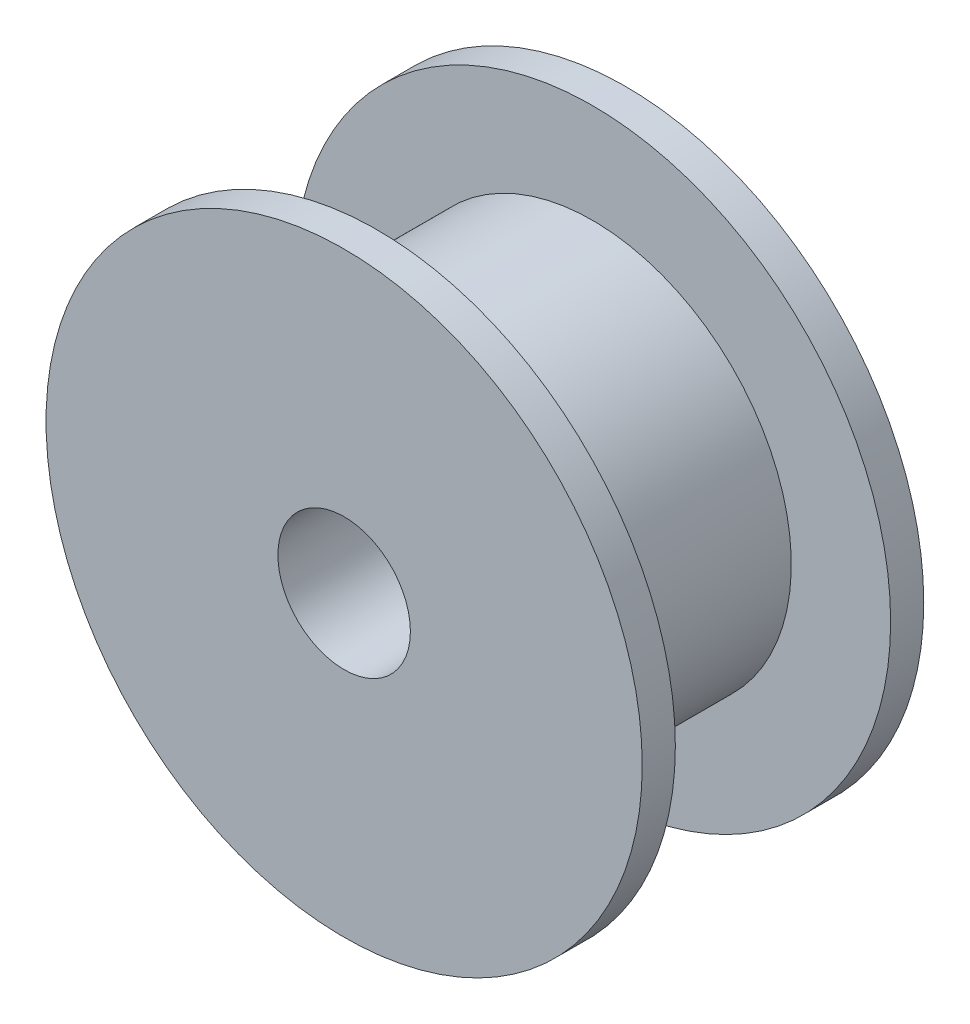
ISO-10303-21;
HEADER;
FILE_DESCRIPTION(('STEP AP214'),'2;1');
FILE_NAME('part.step','',(''),(''),'','','');
FILE_SCHEMA(('AUTOMOTIVE_DESIGN { 1 0 10303 214 1 1 1 1 }'));
ENDSEC;
DATA;
#1=APPLICATION_CONTEXT('core data for automotive mechanical design processes');
#2=APPLICATION_PROTOCOL_DEFINITION('international standard','automotive_design',2000,#1);
#3=PRODUCT_CONTEXT('',#1,'mechanical');
#4=PRODUCT('Part','Part','',(#3));
#5=PRODUCT_RELATED_PRODUCT_CATEGORY('part','',(#4));
#6=PRODUCT_DEFINITION_FORMATION('','',#4);
#7=PRODUCT_DEFINITION_CONTEXT('part definition',#1,'design');
#8=PRODUCT_DEFINITION('design','',#6,#7);
#9=PRODUCT_DEFINITION_SHAPE('','',#8);
#10=(LENGTH_UNIT() NAMED_UNIT(*) SI_UNIT(.MILLI.,.METRE.));
#11=(NAMED_UNIT(*) PLANE_ANGLE_UNIT() SI_UNIT($,.RADIAN.));
#12=(NAMED_UNIT(*) SI_UNIT($,.STERADIAN.) SOLID_ANGLE_UNIT());
#13=UNCERTAINTY_MEASURE_WITH_UNIT(LENGTH_MEASURE(1.E-05),#10,'distance_accuracy_value','');
#14=(GEOMETRIC_REPRESENTATION_CONTEXT(3) GLOBAL_UNCERTAINTY_ASSIGNED_CONTEXT((#13)) GLOBAL_UNIT_ASSIGNED_CONTEXT((#10,
#11,#12)) REPRESENTATION_CONTEXT('',''));
#15=CARTESIAN_POINT('',(0.,0.,0.));
#16=DIRECTION('',(0.,0.,1.));
#17=DIRECTION('',(1.,0.,0.));
#18=AXIS2_PLACEMENT_3D('',#15,#16,#17);
#19=CARTESIAN_POINT('',(0.,0.,1.));
#20=DIRECTION('',(0.,0.,1.));
#21=DIRECTION('',(1.,0.,0.));
#22=AXIS2_PLACEMENT_3D('',#19,#20,#21);
#23=PLANE('',#22);
#24=CARTESIAN_POINT('',(0.,0.,1.));
#25=DIRECTION('',(0.,0.,1.));
#26=DIRECTION('',(1.,0.,0.));
#27=AXIS2_PLACEMENT_3D('',#24,#25,#26);
#28=CIRCLE('',#27,9.);
#29=CARTESIAN_POINT('',(9.,0.,1.));
#30=VERTEX_POINT('',#29);
#31=EDGE_CURVE('E10',#30,#30,#28,.T.);
#32=ORIENTED_EDGE('',*,*,#31,.T.);
#33=EDGE_LOOP('',(#32));
#34=FACE_BOUND('',#33,.T.);
#35=CARTESIAN_POINT('',(0.,0.,1.));
#36=DIRECTION('',(0.,0.,1.));
#37=DIRECTION('',(1.,0.,0.));
#38=AXIS2_PLACEMENT_3D('',#35,#36,#37);
#39=CIRCLE('',#38,6.);
#40=CARTESIAN_POINT('',(-6.,0.,1.));
#41=VERTEX_POINT('',#40);
#42=EDGE_CURVE('E56',#41,#41,#39,.T.);
#43=ORIENTED_EDGE('',*,*,#42,.F.);
#44=EDGE_LOOP('',(#43));
#45=FACE_BOUND('',#44,.T.);
#46=ADVANCED_FACE('F37',(#34,#45),#23,.T.);
#47=CARTESIAN_POINT('',(0.,0.,0.));
#48=DIRECTION('',(0.,0.,1.));
#49=DIRECTION('',(1.,0.,0.));
#50=AXIS2_PLACEMENT_3D('',#47,#48,#49);
#51=PLANE('',#50);
#52=CARTESIAN_POINT('',(0.,0.,0.));
#53=DIRECTION('',(0.,0.,1.));
#54=DIRECTION('',(1.,0.,0.));
#55=AXIS2_PLACEMENT_3D('',#52,#53,#54);
#56=CIRCLE('',#55,9.);
#57=CARTESIAN_POINT('',(9.,0.,0.));
#58=VERTEX_POINT('',#57);
#59=EDGE_CURVE('E41',#58,#58,#56,.T.);
#60=ORIENTED_EDGE('',*,*,#59,.F.);
#61=EDGE_LOOP('',(#60));
#62=FACE_BOUND('',#61,.T.);
#63=CARTESIAN_POINT('',(0.,0.,0.));
#64=DIRECTION('',(0.,0.,1.));
#65=DIRECTION('',(1.,0.,0.));
#66=AXIS2_PLACEMENT_3D('',#63,#64,#65);
#67=CIRCLE('',#66,2.);
#68=CARTESIAN_POINT('',(2.,0.,0.));
#69=VERTEX_POINT('',#68);
#70=EDGE_CURVE('E50',#69,#69,#67,.T.);
#71=ORIENTED_EDGE('',*,*,#70,.T.);
#72=EDGE_LOOP('',(#71));
#73=FACE_BOUND('',#72,.T.);
#74=ADVANCED_FACE('F94',(#62,#73),#51,.F.);
#75=CARTESIAN_POINT('',(0.,0.,1.));
#76=DIRECTION('',(0.,0.,-1.));
#77=DIRECTION('',(-1.,0.,0.));
#78=AXIS2_PLACEMENT_3D('',#75,#76,#77);
#79=CYLINDRICAL_SURFACE('',#78,9.);
#80=ORIENTED_EDGE('',*,*,#31,.F.);
#81=EDGE_LOOP('',(#80));
#82=FACE_BOUND('',#81,.T.);
#83=ORIENTED_EDGE('',*,*,#59,.T.);
#84=EDGE_LOOP('',(#83));
#85=FACE_BOUND('',#84,.T.);
#86=ADVANCED_FACE('F39',(#82,#85),#79,.T.);
#87=CARTESIAN_POINT('',(0.,0.,1.));
#88=DIRECTION('',(0.,0.,-1.));
#89=DIRECTION('',(-1.,0.,0.));
#90=AXIS2_PLACEMENT_3D('',#87,#88,#89);
#91=CYLINDRICAL_SURFACE('',#90,2.);
#92=ORIENTED_EDGE('',*,*,#70,.F.);
#93=EDGE_LOOP('',(#92));
#94=FACE_BOUND('',#93,.T.);
#95=CARTESIAN_POINT('',(0.,0.,8.5));
#96=DIRECTION('',(0.,0.,1.));
#97=DIRECTION('',(1.,0.,0.));
#98=AXIS2_PLACEMENT_3D('',#95,#96,#97);
#99=CIRCLE('',#98,2.);
#100=CARTESIAN_POINT('',(2.,0.,8.5));
#101=VERTEX_POINT('',#100);
#102=EDGE_CURVE('E68',#101,#101,#99,.T.);
#103=ORIENTED_EDGE('',*,*,#102,.T.);
#104=EDGE_LOOP('',(#103));
#105=FACE_BOUND('',#104,.T.);
#106=ADVANCED_FACE('F76',(#94,#105),#91,.F.);
#107=CARTESIAN_POINT('',(0.,0.,7.5));
#108=DIRECTION('',(0.,0.,-1.));
#109=DIRECTION('',(-1.,0.,0.));
#110=AXIS2_PLACEMENT_3D('',#107,#108,#109);
#111=CYLINDRICAL_SURFACE('',#110,6.);
#112=CARTESIAN_POINT('',(0.,0.,7.5));
#113=DIRECTION('',(0.,0.,1.));
#114=DIRECTION('',(1.,0.,0.));
#115=AXIS2_PLACEMENT_3D('',#112,#113,#114);
#116=CIRCLE('',#115,6.);
#117=CARTESIAN_POINT('',(-6.,0.,7.5));
#118=VERTEX_POINT('',#117);
#119=EDGE_CURVE('E55',#118,#118,#116,.T.);
#120=CARTESIAN_POINT('',(-6.,0.,7.5));
#121=CARTESIAN_POINT('',(-6.,0.,7.43229166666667));
#122=CARTESIAN_POINT('',(-6.,0.,7.36458333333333));
#123=CARTESIAN_POINT('',(-6.,0.,7.22916666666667));
#124=CARTESIAN_POINT('',(-6.,0.,7.16145833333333));
#125=CARTESIAN_POINT('',(-6.,0.,7.02604166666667));
#126=CARTESIAN_POINT('',(-6.,0.,6.95833333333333));
#127=CARTESIAN_POINT('',(-6.,0.,6.82291666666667));
#128=CARTESIAN_POINT('',(-6.,0.,6.75520833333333));
#129=CARTESIAN_POINT('',(-6.,0.,6.61979166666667));
#130=CARTESIAN_POINT('',(-6.,0.,6.55208333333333));
#131=CARTESIAN_POINT('',(-6.,0.,6.41666666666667));
#132=CARTESIAN_POINT('',(-6.,0.,6.34895833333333));
#133=CARTESIAN_POINT('',(-6.,0.,6.21354166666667));
#134=CARTESIAN_POINT('',(-6.,0.,6.14583333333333));
#135=CARTESIAN_POINT('',(-6.,0.,6.01041666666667));
#136=CARTESIAN_POINT('',(-6.,0.,5.94270833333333));
#137=CARTESIAN_POINT('',(-6.,0.,5.80729166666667));
#138=CARTESIAN_POINT('',(-6.,0.,5.73958333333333));
#139=CARTESIAN_POINT('',(-6.,0.,5.60416666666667));
#140=CARTESIAN_POINT('',(-6.,0.,5.53645833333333));
#141=CARTESIAN_POINT('',(-6.,0.,5.40104166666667));
#142=CARTESIAN_POINT('',(-6.,0.,5.33333333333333));
#143=CARTESIAN_POINT('',(-6.,0.,5.19791666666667));
#144=CARTESIAN_POINT('',(-6.,0.,5.13020833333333));
#145=CARTESIAN_POINT('',(-6.,0.,4.99479166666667));
#146=CARTESIAN_POINT('',(-6.,0.,4.92708333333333));
#147=CARTESIAN_POINT('',(-6.,0.,4.79166666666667));
#148=CARTESIAN_POINT('',(-6.,0.,4.72395833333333));
#149=CARTESIAN_POINT('',(-6.,0.,4.58854166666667));
#150=CARTESIAN_POINT('',(-6.,0.,4.52083333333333));
#151=CARTESIAN_POINT('',(-6.,0.,4.38541666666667));
#152=CARTESIAN_POINT('',(-6.,0.,4.31770833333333));
#153=CARTESIAN_POINT('',(-6.,0.,4.18229166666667));
#154=CARTESIAN_POINT('',(-6.,0.,4.11458333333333));
#155=CARTESIAN_POINT('',(-6.,0.,3.97916666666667));
#156=CARTESIAN_POINT('',(-6.,0.,3.91145833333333));
#157=CARTESIAN_POINT('',(-6.,0.,3.77604166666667));
#158=CARTESIAN_POINT('',(-6.,0.,3.70833333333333));
#159=CARTESIAN_POINT('',(-6.,0.,3.57291666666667));
#160=CARTESIAN_POINT('',(-6.,0.,3.50520833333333));
#161=CARTESIAN_POINT('',(-6.,0.,3.36979166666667));
#162=CARTESIAN_POINT('',(-6.,0.,3.30208333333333));
#163=CARTESIAN_POINT('',(-6.,0.,3.16666666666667));
#164=CARTESIAN_POINT('',(-6.,0.,3.09895833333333));
#165=CARTESIAN_POINT('',(-6.,0.,2.96354166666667));
#166=CARTESIAN_POINT('',(-6.,0.,2.89583333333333));
#167=CARTESIAN_POINT('',(-6.,0.,2.76041666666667));
#168=CARTESIAN_POINT('',(-6.,0.,2.69270833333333));
#169=CARTESIAN_POINT('',(-6.,0.,2.55729166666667));
#170=CARTESIAN_POINT('',(-6.,0.,2.48958333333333));
#171=CARTESIAN_POINT('',(-6.,0.,2.35416666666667));
#172=CARTESIAN_POINT('',(-6.,0.,2.28645833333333));
#173=CARTESIAN_POINT('',(-6.,0.,2.15104166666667));
#174=CARTESIAN_POINT('',(-6.,0.,2.08333333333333));
#175=CARTESIAN_POINT('',(-6.,0.,1.94791666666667));
#176=CARTESIAN_POINT('',(-6.,0.,1.88020833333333));
#177=CARTESIAN_POINT('',(-6.,0.,1.74479166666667));
#178=CARTESIAN_POINT('',(-6.,0.,1.67708333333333));
#179=CARTESIAN_POINT('',(-6.,0.,1.54166666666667));
#180=CARTESIAN_POINT('',(-6.,0.,1.47395833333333));
#181=CARTESIAN_POINT('',(-6.,0.,1.33854166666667));
#182=CARTESIAN_POINT('',(-6.,0.,1.27083333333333));
#183=CARTESIAN_POINT('',(-6.,0.,1.13541666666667));
#184=CARTESIAN_POINT('',(-6.,0.,1.06770833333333));
#185=CARTESIAN_POINT('',(-6.,0.,1.));
#186=B_SPLINE_CURVE_WITH_KNOTS('',3,(#120,#121,#122,#123,#124,#125,#126,#127,#128,#129,#130,
#131,#132,#133,#134,#135,#136,#137,#138,#139,#140,#141,#142,#143,#144,#145,#146,#147,#148,#149,
#150,#151,#152,#153,#154,#155,#156,#157,#158,#159,#160,#161,#162,#163,#164,#165,#166,#167,#168,
#169,#170,#171,#172,#173,#174,#175,#176,#177,#178,#179,#180,#181,#182,#183,#184,#185),
.UNSPECIFIED.,.F.,.F.,(4,2,2,2,2,2,2,2,2,2,2,2,2,2,2,2,2,2,2,2,2,2,2,2,2,2,2,2,2,2,2,2,4),(0.,
0.203125,0.40625,0.609375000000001,0.812500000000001,1.015625,1.21875,1.421875,1.625,1.828125,
2.03125,2.234375,2.4375,2.640625,2.84375,3.046875,3.25,3.453125,3.65625,3.859375,4.0625,
4.265625,4.46875,4.671875,4.875,5.078125,5.28125,5.484375,5.6875,5.890625,6.09375,6.296875,6.5),.UNSPECIFIED.);
#187=EDGE_CURVE('BSEAM81',#118,#41,#186,.T.);
#188=ORIENTED_EDGE('',*,*,#119,.F.);
#189=ORIENTED_EDGE('',*,*,#42,.T.);
#190=ORIENTED_EDGE('',*,*,#187,.T.);
#191=ORIENTED_EDGE('',*,*,#187,.F.);
#192=EDGE_LOOP('',(#188,#190,#189,#191));
#193=FACE_BOUND('',#192,.T.);
#194=ADVANCED_FACE('F81',(#193),#111,.T.);
#195=CARTESIAN_POINT('',(0.,0.,8.5));
#196=DIRECTION('',(0.,0.,1.));
#197=DIRECTION('',(1.,0.,0.));
#198=AXIS2_PLACEMENT_3D('',#195,#196,#197);
#199=PLANE('',#198);
#200=CARTESIAN_POINT('',(0.,0.,8.5));
#201=DIRECTION('',(0.,0.,1.));
#202=DIRECTION('',(1.,0.,0.));
#203=AXIS2_PLACEMENT_3D('',#200,#201,#202);
#204=CIRCLE('',#203,9.);
#205=CARTESIAN_POINT('',(9.,0.,8.5));
#206=VERTEX_POINT('',#205);
#207=EDGE_CURVE('E60',#206,#206,#204,.T.);
#208=ORIENTED_EDGE('',*,*,#207,.T.);
#209=EDGE_LOOP('',(#208));
#210=FACE_BOUND('',#209,.T.);
#211=ORIENTED_EDGE('',*,*,#102,.F.);
#212=EDGE_LOOP('',(#211));
#213=FACE_BOUND('',#212,.T.);
#214=ADVANCED_FACE('F78',(#210,#213),#199,.T.);
#215=CARTESIAN_POINT('',(0.,0.,7.5));
#216=DIRECTION('',(0.,0.,1.));
#217=DIRECTION('',(1.,0.,0.));
#218=AXIS2_PLACEMENT_3D('',#215,#216,#217);
#219=PLANE('',#218);
#220=ORIENTED_EDGE('',*,*,#119,.T.);
#221=EDGE_LOOP('',(#220));
#222=FACE_BOUND('',#221,.T.);
#223=CARTESIAN_POINT('',(0.,0.,7.5));
#224=DIRECTION('',(0.,0.,1.));
#225=DIRECTION('',(1.,0.,0.));
#226=AXIS2_PLACEMENT_3D('',#223,#224,#225);
#227=CIRCLE('',#226,9.);
#228=CARTESIAN_POINT('',(9.,0.,7.5));
#229=VERTEX_POINT('',#228);
#230=EDGE_CURVE('E64',#229,#229,#227,.T.);
#231=ORIENTED_EDGE('',*,*,#230,.F.);
#232=EDGE_LOOP('',(#231));
#233=FACE_BOUND('',#232,.T.);
#234=ADVANCED_FACE('F80',(#222,#233),#219,.F.);
#235=CARTESIAN_POINT('',(0.,0.,8.5));
#236=DIRECTION('',(0.,0.,-1.));
#237=DIRECTION('',(-1.,0.,0.));
#238=AXIS2_PLACEMENT_3D('',#235,#236,#237);
#239=CYLINDRICAL_SURFACE('',#238,9.);
#240=ORIENTED_EDGE('',*,*,#207,.F.);
#241=EDGE_LOOP('',(#240));
#242=FACE_BOUND('',#241,.T.);
#243=ORIENTED_EDGE('',*,*,#230,.T.);
#244=EDGE_LOOP('',(#243));
#245=FACE_BOUND('',#244,.T.);
#246=ADVANCED_FACE('F88',(#242,#245),#239,.T.);
#247=CLOSED_SHELL('',(#46,#74,#86,#106,#194,#214,#234,#246));
#248=MANIFOLD_SOLID_BREP('B2',#247);
#249=ADVANCED_BREP_SHAPE_REPRESENTATION('',(#18,#248),#14);
#250=SHAPE_DEFINITION_REPRESENTATION(#9,#249);
ENDSEC;
END-ISO-10303-21;
